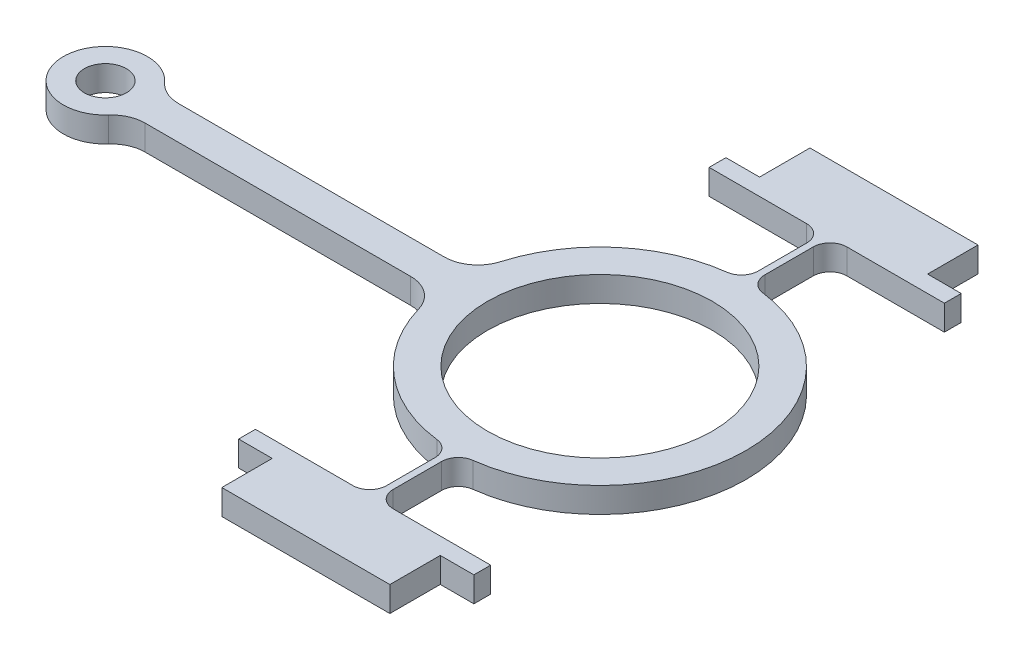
from build123d import *

# Parameters (mm, degrees)
SKETCH2_R           = 8.5
BOSS_EXTRUDE1_DEPTH = 0.95
FILLET1_R           = 1.27
SKETCH3_R           = 3.175
BOSS_EXTRUDE2_DEPTH = 1.9
SKETCH4_R           = 1.5875
CUT_EXTRUDE1_DEPTH  = 47.278367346
SKETCH5_W           = 17.78
SKETCH5_H           = 1.27
BOSS_EXTRUDE3_DEPTH = 1.9
FILLET2_R           = 2.54


with BuildPart() as part:
    # Sketch2 → Boss-Extrude1 (new, symmetric)
    with BuildSketch(Plane(origin=(0, 0, 0), x_dir=(1, 0, 0), z_dir=(0, 1, 0))):
        with BuildLine():
            Line((0.25, 17.145), (6.35, 17.145))
            Line((6.35, 17.145), (6.35, 22.225))
            Line((6.35, 22.225), (-6.35, 22.225))
            Line((-6.35, 22.225), (-6.35, 17.145))
            Line((-6.35, 17.145), (-0.25, 17.145))
            Line((-0.25, 17.145), (-0.25, 11.037169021))
            ThreePointArc((-0.25, 11.037169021), (-7.436601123, 8.159568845), (-10.966708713, 1.27))
            Line((-10.966708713, 1.27), (-37.372831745, 1.27))
            Line((-37.372831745, 1.27), (-37.372831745, -1.27))
            Line((-37.372831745, -1.27), (-10.966708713, -1.27))
            ThreePointArc((-10.966708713, -1.27), (-7.436601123, -8.159568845), (-0.25, -11.037169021))
            Line((-0.25, -11.037169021), (-0.25, -17.145))
            Line((-0.25, -17.145), (-6.35, -17.145))
            Line((-6.35, -17.145), (-6.35, -22.225))
            Line((-6.35, -22.225), (6.35, -22.225))
            Line((6.35, -22.225), (6.35, -17.145))
            Line((6.35, -17.145), (0.25, -17.145))
            Line((0.25, -17.145), (0.25, -11.037169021))
            ThreePointArc((0.25, -11.037169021), (11.04, 0), (0.25, 11.037169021))
            Line((0.25, 11.037169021), (0.25, 17.145))
        make_face()
        with Locations(Location((0, 0, 0), (0, 0, 90))):
            Circle(SKETCH2_R, mode=Mode.SUBTRACT)
    extrude(amount=BOSS_EXTRUDE1_DEPTH, both=True)

    # Fillet1
    fillet1_edges = [part.edges().sort_by_distance(p)[0] for p in [
        (-0.25, 0, 11.037169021),
        (-0.25, 0, -11.037169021),
        (-0.25, 0, -17.145),
        (0.25, 0, -17.145),
        (0.25, 0, -11.037169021),
        (0.25, 0, 11.037169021),
        (0.25, 0, 17.145),
        (-0.25, 0, 17.145),
    ]]
    fillet(fillet1_edges, radius=FILLET1_R)

    # Sketch3 → Boss-Extrude2 (add)
    with BuildSketch(Plane(origin=(0, 0.95, 0), x_dir=(1, 0, 0), z_dir=(0, 1, 0))):
        with Locations((-37.372831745, 0)):
            Circle(SKETCH3_R)
    extrude(amount=-BOSS_EXTRUDE2_DEPTH)

    # Sketch4 → Cut-Extrude1 (cut, through all)
    with BuildSketch(Plane(origin=(0, 0.95, 0), x_dir=(1, 0, 0), z_dir=(0, 1, 0))):
        with Locations(Location((-37.372831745, 0, 0), (0, 0, 270))):
            Circle(SKETCH4_R)
    extrude(amount=-CUT_EXTRUDE1_DEPTH, mode=Mode.SUBTRACT)

    # Sketch5 → Boss-Extrude3 (add)
    with BuildSketch(Plane(origin=(0, 0.95, 0), x_dir=(1, 0, 0), z_dir=(0, 1, 0))):
        with Locations((0, 17.78)):
            Rectangle(SKETCH5_W, SKETCH5_H)
    boss_extrude3 = extrude(amount=-BOSS_EXTRUDE3_DEPTH)

    # Mirror1: Boss-Extrude3 across plane
    add(boss_extrude3.mirror(Plane.XY))

    # Fillet2
    fillet2_edges = [part.edges().sort_by_distance(p)[0] for p in [
        (-34.462896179, 0, 1.27),
        (-34.462896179, 0, -1.27),
        (-10.966708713, 0, 1.27),
        (-10.966708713, 0, -1.27),
    ]]
    fillet(fillet2_edges, radius=FILLET2_R)


solid = part.part
